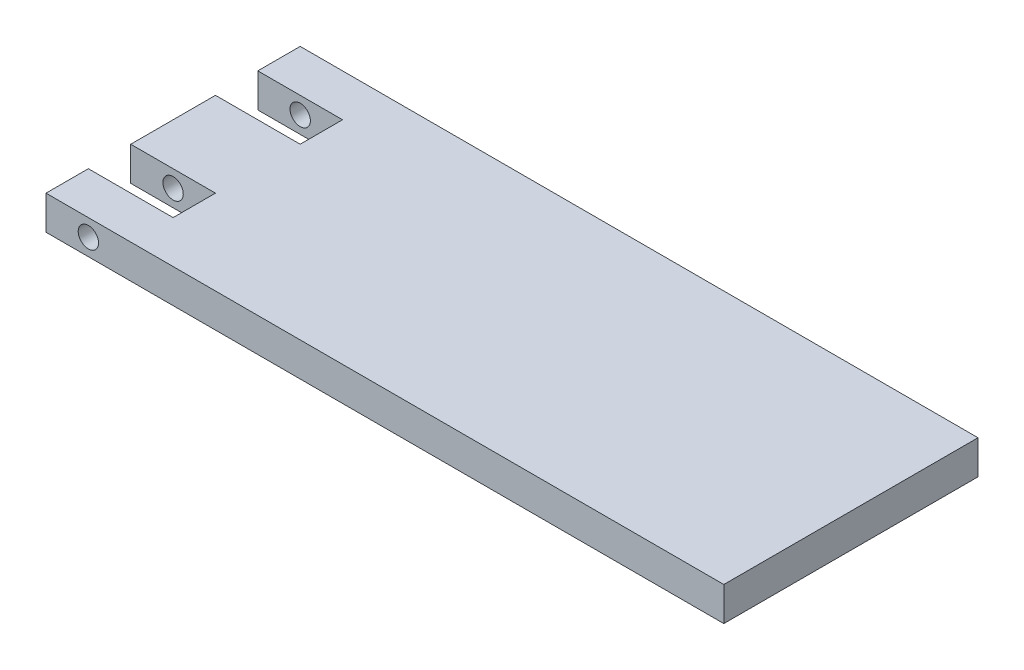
from build123d import *

# Parameters (mm, degrees)
SCHIZZO1_W        = 400
SCHIZZO1_H        = 150
ESTRUSIONE1_DEPTH = 20
SCHIZZO2_W        = 50
SCHIZZO2_H        = 25
ESTRUSIONE2_DEPTH = 408.461654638
SCHIZZO3_R        = 6
ESTRUSIONE3_DEPTH = 428.668095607


with BuildPart() as part:
    # Schizzo1 → Estrusione1 (new body)
    with BuildSketch(Plane(origin=(0, 0, 0), x_dir=(1, 0, 0), z_dir=(0, 1, 0))):
        with Locations((200, 0)):
            Rectangle(SCHIZZO1_W, SCHIZZO1_H)
    extrude(amount=ESTRUSIONE1_DEPTH)

    # Schizzo2 → Estrusione2 (cut, through all)
    with BuildSketch(Plane(origin=(0, 20, 0), x_dir=(1, 0, 0), z_dir=(0, 1, 0))):
        with Locations((25, 37.5)):
            Rectangle(SCHIZZO2_W, SCHIZZO2_H)
    estrusione2 = extrude(amount=-ESTRUSIONE2_DEPTH, mode=Mode.SUBTRACT)

    # Specchia1: Estrusione2 across plane
    add(estrusione2.mirror(Plane.XY), mode=Mode.SUBTRACT)

    # Schizzo3 → Estrusione3 (cut, through all)
    with BuildSketch(Plane.XY.offset(75)):
        with Locations((25, 10)):
            Circle(SCHIZZO3_R)
    extrude(amount=-ESTRUSIONE3_DEPTH, mode=Mode.SUBTRACT)


solid = part.part
